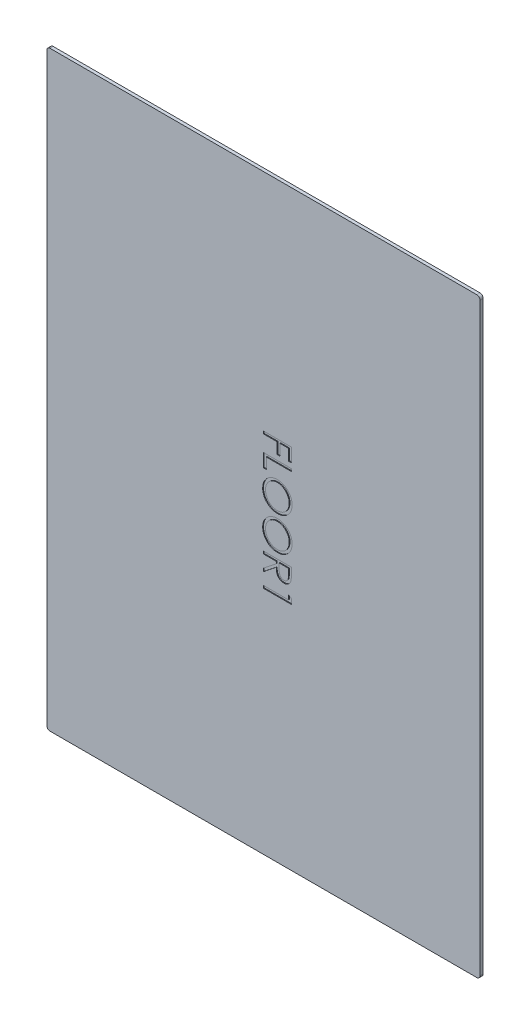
from build123d import *

# Parameters (mm, degrees)
ESQUISSE1_W             = 542
ESQUISSE1_H             = 740
BOSS_EXTRU_1_DEPTH      = 4
CONG_1_R                = 4
ENL_V_MAT_EXTRU_1_DEPTH = 1


with BuildPart() as part:
    # Esquisse1 → Boss.-Extru.1 (new body)
    with BuildSketch(Plane.XY):
        with Locations((-271, -370)):
            Rectangle(ESQUISSE1_W, ESQUISSE1_H)
    extrude(amount=BOSS_EXTRU_1_DEPTH)

    # Cong_1
    cong_1_edges = [part.edges().sort_by_distance(p)[0] for p in [
        (0, -740, 2),
        (-542, -740, 2),
        (-542, 0, 2),
        (0, 0, 2),
    ]]
    fillet(cong_1_edges, radius=CONG_1_R)

    # Esquisse2 → Enl_v. mat.-Extru.1 (cut)
    # profile 1 of 6: a face of its own
    with BuildSketch(Plane.XY.offset(4)):
        Polygon((-236, -281.153846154), (-236, -298.205128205), (-239.58974359, -298.205128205), (-239.58974359, -284.294871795), (-250.358974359, -284.294871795), (-250.358974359, -298.205128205), (-253.948717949, -298.205128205), (-253.948717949, -284.294871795), (-271, -284.294871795), (-271, -281.153846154), align=None)
    # profile 2 of 6: a face of its own
    with BuildSketch(Plane.XY.offset(4)):
        Polygon((-236, -304.487179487), (-236, -307.628205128), (-267.41025641, -307.628205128), (-267.41025641, -321.08974359), (-271, -321.08974359), (-271, -304.487179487), align=None)
    # profile 3 of 6: a face of its own
    with BuildSketch(Plane.XY.offset(4)):
        with BuildLine():
            add(Edge.make_bspline(
                [(-235.102564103, -343.301282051), (-235.118979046, -343.94936298), (-235.151219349, -345.222247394), (-235.398008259, -347.092998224), (-235.824969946, -348.878942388), (-236.393571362, -350.594668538), (-237.152220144, -352.219506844), (-238.068678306, -353.766238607), (-239.155980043, -355.230490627), (-240.395880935, -356.598841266), (-241.749861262, -357.846415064), (-243.198967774, -358.936411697), (-244.723357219, -359.857995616), (-246.328334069, -360.613353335), (-248.006834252, -361.20647446), (-249.76840141, -361.615628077), (-251.601460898, -361.877019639), (-252.851730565, -361.907576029), (-253.485977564, -361.923076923)],
                knots=[0, 0, 0, 0, 1.06508495, 2.091914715, 3.094501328, 4.079693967, 5.057647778, 6.035986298, 7.030177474, 8.050107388, 9.066943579, 10.051896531, 11.025616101, 11.9896488, 12.96281505, 13.945825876, 14.957941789, 16, 16, 16, 16], degree=3))
            add(Edge.make_bspline(
                [(-253.485977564, -361.923076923), (-254.115552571, -361.907578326), (-255.356517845, -361.877028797), (-257.177944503, -361.615330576), (-258.928880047, -361.204958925), (-260.606231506, -360.61885528), (-262.212399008, -359.867126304), (-263.739590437, -358.939313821), (-265.198730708, -357.85653367), (-266.559283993, -356.613272), (-267.809308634, -355.259614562), (-268.900999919, -353.806421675), (-269.833930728, -352.283532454), (-270.584107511, -350.679525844), (-271.181426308, -349.012283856), (-271.589061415, -347.266526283), (-271.8519022, -345.450042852), (-271.882091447, -344.211335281), (-271.897435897, -343.581730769)],
                knots=[0, 0, 0, 0, 1.04355943, 2.056976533, 3.044937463, 4.02179873, 4.997890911, 5.980248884, 6.980147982, 8.006253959, 9.032111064, 10.031228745, 11.015595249, 11.988180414, 12.962670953, 13.946861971, 14.95644057, 16, 16, 16, 16], degree=3))
            add(Edge.make_bspline(
                [(-271.897435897, -343.581730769), (-271.881944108, -342.947486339), (-271.851405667, -341.697221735), (-271.589561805, -339.861869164), (-271.1802581, -338.099026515), (-270.594763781, -336.414121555), (-269.840929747, -334.806601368), (-268.914579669, -333.276621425), (-267.823003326, -331.822343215), (-266.581396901, -330.458565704), (-265.227088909, -329.212257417), (-263.783447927, -328.116057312), (-262.264203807, -327.195047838), (-260.675619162, -326.440895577), (-259.021800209, -325.844389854), (-257.292343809, -325.437303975), (-255.496941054, -325.17395468), (-254.274513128, -325.143604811), (-253.654246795, -325.128205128)],
                knots=[0, 0, 0, 0, 1.053167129, 2.076072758, 3.073341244, 4.055601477, 5.033424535, 6.017524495, 7.021518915, 8.049444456, 9.077120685, 10.074910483, 11.055688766, 12.022980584, 12.991883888, 13.970269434, 14.970104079, 16, 16, 16, 16], degree=3))
            add(Edge.make_bspline(
                [(-253.654246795, -325.128205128), (-253.237918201, -325.133546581), (-252.410513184, -325.144162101), (-251.181875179, -325.272151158), (-249.972863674, -325.457497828), (-248.78754278, -325.72451813), (-247.625718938, -326.068951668), (-246.489768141, -326.493407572), (-245.370333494, -326.979834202), (-244.288719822, -327.558992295), (-243.243229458, -328.190871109), (-242.246935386, -328.879871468), (-241.317634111, -329.630797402), (-240.440393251, -330.432922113), (-239.630185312, -331.297348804), (-238.869345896, -332.21106788), (-238.165750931, -333.178860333), (-237.534177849, -334.202256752), (-236.9540703, -335.255165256), (-236.469728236, -336.345224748), (-236.041634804, -337.449436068), (-235.701427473, -338.577525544), (-235.430688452, -339.726883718), (-235.246728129, -340.898947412), (-235.118454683, -342.092509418), (-235.107883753, -342.896624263), (-235.102564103, -343.301282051)],
                knots=[0, 0, 0, 0, 1.037115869, 2.061148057, 3.07517727, 4.084041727, 5.086514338, 6.092668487, 7.104487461, 8.125783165, 9.147610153, 10.147694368, 11.141876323, 12.122903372, 13.107606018, 14.091946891, 15.084523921, 16.086505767, 17.087268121, 18.077809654, 19.05670789, 20.036870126, 21.011670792, 21.99694167, 22.991993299, 24, 24, 24, 24], degree=3))
        make_face()
        with BuildLine():
            add(Edge.make_bspline(
                [(-238.692307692, -343.455528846), (-238.696354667, -343.123381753), (-238.704409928, -342.462262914), (-238.810595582, -341.479428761), (-238.961787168, -340.509467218), (-239.178002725, -339.552431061), (-239.469885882, -338.613470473), (-239.81380792, -337.683208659), (-240.218380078, -336.766112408), (-240.690121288, -335.872434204), (-241.205447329, -335.00366783), (-241.771035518, -334.178267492), (-242.384143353, -333.404467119), (-243.036672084, -332.679787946), (-243.735260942, -332.006341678), (-244.468760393, -331.370477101), (-245.258286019, -330.797786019), (-246.082388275, -330.272928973), (-246.940004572, -329.803250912), (-247.822103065, -329.385597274), (-248.735879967, -329.04395721), (-249.671421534, -328.765333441), (-250.627246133, -328.534335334), (-251.61060462, -328.387996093), (-252.616555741, -328.280672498), (-253.296374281, -328.273074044), (-253.640224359, -328.269230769)],
                knots=[0, 0, 0, 0, 1.008585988, 2.007529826, 2.999688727, 3.990042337, 4.984966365, 5.984641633, 7.001812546, 8.027570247, 9.052811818, 10.068991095, 11.064725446, 12.050001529, 13.029093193, 14.010961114, 14.996492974, 15.989185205, 16.977398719, 17.96520407, 18.951579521, 19.937648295, 20.929603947, 21.935788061, 22.955928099, 24, 24, 24, 24], degree=3))
            add(Edge.make_bspline(
                [(-253.640224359, -328.269230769), (-254.145846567, -328.281979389), (-255.14056187, -328.307059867), (-256.598243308, -328.526635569), (-257.999126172, -328.864855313), (-259.335545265, -329.363428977), (-260.618988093, -329.986935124), (-261.83806914, -330.757204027), (-262.993117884, -331.669794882), (-264.076070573, -332.706430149), (-265.064528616, -333.839657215), (-265.932162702, -335.042984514), (-266.6662652, -336.303520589), (-267.264315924, -337.624552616), (-267.738213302, -338.999028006), (-268.062999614, -340.435803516), (-268.276754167, -341.925308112), (-268.297281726, -342.940614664), (-268.307692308, -343.455528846)],
                knots=[0, 0, 0, 0, 1.032063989, 2.030389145, 3.003944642, 3.970395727, 4.937377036, 5.913328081, 6.909231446, 7.93887556, 8.970685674, 9.976071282, 10.964166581, 11.944589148, 12.933237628, 13.927779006, 14.949070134, 16, 16, 16, 16], degree=3))
            add(Edge.make_bspline(
                [(-268.307692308, -343.455528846), (-268.302937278, -343.801623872), (-268.293506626, -344.488034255), (-268.198519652, -345.508989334), (-268.04620173, -346.511551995), (-267.826892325, -347.494312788), (-267.552430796, -348.45616832), (-267.226314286, -349.401088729), (-266.819649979, -350.319175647), (-266.369613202, -351.221381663), (-265.860258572, -352.085129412), (-265.302576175, -352.904616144), (-264.700433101, -353.67509096), (-264.053570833, -354.39822266), (-263.3675655, -355.076335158), (-262.624778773, -355.691014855), (-261.846903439, -356.270566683), (-261.020878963, -356.793322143), (-260.161455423, -357.262066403), (-259.276015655, -357.669668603), (-258.367602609, -358.015679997), (-257.434676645, -358.294951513), (-256.479070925, -358.513809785), (-255.499489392, -358.664607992), (-254.49789617, -358.770092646), (-253.820457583, -358.778043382), (-253.478966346, -358.782051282)],
                knots=[0, 0, 0, 0, 1.047226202, 2.076964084, 3.100341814, 4.114585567, 5.122123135, 6.126552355, 7.137064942, 8.158803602, 9.176592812, 10.169297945, 11.156925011, 12.133779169, 13.104132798, 14.073170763, 15.049307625, 16.038276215, 17.028988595, 18.010110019, 18.986169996, 19.968539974, 20.955178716, 21.950601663, 22.966915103, 24, 24, 24, 24], degree=3))
            add(Edge.make_bspline(
                [(-253.478966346, -358.782051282), (-253.139811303, -358.778040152), (-252.467034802, -358.770083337), (-251.472426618, -358.664658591), (-250.499894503, -358.513649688), (-249.553256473, -358.296022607), (-248.632271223, -358.01552107), (-247.737803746, -357.669647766), (-246.866521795, -357.261794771), (-246.020578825, -356.793712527), (-245.208831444, -356.267554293), (-244.432807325, -355.692611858), (-243.707079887, -355.058958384), (-243.013733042, -354.384698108), (-242.367553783, -353.652989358), (-241.76832996, -352.867146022), (-241.201591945, -352.036710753), (-240.690356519, -351.157432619), (-240.218138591, -350.250014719), (-239.813906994, -349.318795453), (-239.468398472, -348.372692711), (-239.179197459, -347.416550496), (-238.961575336, -346.443633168), (-238.810649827, -345.45960644), (-238.704398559, -344.462788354), (-238.696350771, -343.792347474), (-238.692307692, -343.455528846)],
                knots=[0, 0, 0, 0, 1.029967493, 2.04313025, 3.035375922, 4.01889446, 4.991458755, 5.958017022, 6.930036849, 7.912118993, 8.892942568, 9.867138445, 10.843712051, 11.817804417, 12.803729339, 13.806387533, 14.818654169, 15.856205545, 16.894655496, 17.924916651, 18.938004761, 19.953404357, 20.957695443, 21.963967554, 22.97713031, 24, 24, 24, 24], degree=3))
        make_face(mode=Mode.SUBTRACT)
    # profile 4 of 6: a face of its own
    with BuildSketch(Plane.XY.offset(4)):
        with BuildLine():
            add(Edge.make_bspline(
                [(-235.102564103, -385.480769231), (-235.118979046, -386.128850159), (-235.151219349, -387.401734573), (-235.398008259, -389.272485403), (-235.824969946, -391.058429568), (-236.393571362, -392.774155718), (-237.152220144, -394.398994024), (-238.068678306, -395.945725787), (-239.155980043, -397.409977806), (-240.395880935, -398.778328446), (-241.749861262, -400.025902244), (-243.198967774, -401.115898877), (-244.723357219, -402.037482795), (-246.328334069, -402.792840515), (-248.006834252, -403.38596164), (-249.76840141, -403.795115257), (-251.601460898, -404.056506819), (-252.851730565, -404.087063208), (-253.485977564, -404.102564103)],
                knots=[0, 0, 0, 0, 1.06508495, 2.091914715, 3.094501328, 4.079693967, 5.057647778, 6.035986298, 7.030177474, 8.050107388, 9.066943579, 10.051896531, 11.025616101, 11.9896488, 12.96281505, 13.945825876, 14.957941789, 16, 16, 16, 16], degree=3))
            add(Edge.make_bspline(
                [(-253.485977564, -404.102564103), (-254.115552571, -404.087065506), (-255.356517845, -404.056515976), (-257.177944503, -403.794817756), (-258.928880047, -403.384446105), (-260.606231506, -402.79834246), (-262.212399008, -402.046613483), (-263.739590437, -401.118801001), (-265.198730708, -400.03602085), (-266.559283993, -398.79275918), (-267.809308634, -397.439101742), (-268.900999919, -395.985908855), (-269.833930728, -394.463019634), (-270.584107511, -392.859013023), (-271.181426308, -391.191771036), (-271.589061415, -389.446013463), (-271.8519022, -387.629530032), (-271.882091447, -386.390822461), (-271.897435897, -385.761217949)],
                knots=[0, 0, 0, 0, 1.04355943, 2.056976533, 3.044937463, 4.02179873, 4.997890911, 5.980248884, 6.980147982, 8.006253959, 9.032111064, 10.031228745, 11.015595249, 11.988180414, 12.962670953, 13.946861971, 14.95644057, 16, 16, 16, 16], degree=3))
            add(Edge.make_bspline(
                [(-271.897435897, -385.761217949), (-271.881944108, -385.126973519), (-271.851405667, -383.876708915), (-271.589561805, -382.041356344), (-271.1802581, -380.278513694), (-270.594763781, -378.593608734), (-269.840929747, -376.986088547), (-268.914579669, -375.456108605), (-267.823003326, -374.001830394), (-266.581396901, -372.638052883), (-265.227088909, -371.391744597), (-263.783447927, -370.295544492), (-262.264203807, -369.374535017), (-260.675619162, -368.620382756), (-259.021800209, -368.023877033), (-257.292343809, -367.616791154), (-255.496941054, -367.35344186), (-254.274513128, -367.32309199), (-253.654246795, -367.307692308)],
                knots=[0, 0, 0, 0, 1.053167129, 2.076072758, 3.073341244, 4.055601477, 5.033424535, 6.017524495, 7.021518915, 8.049444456, 9.077120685, 10.074910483, 11.055688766, 12.022980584, 12.991883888, 13.970269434, 14.970104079, 16, 16, 16, 16], degree=3))
            add(Edge.make_bspline(
                [(-253.654246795, -367.307692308), (-253.237918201, -367.31303376), (-252.410513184, -367.323649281), (-251.181875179, -367.451638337), (-249.972863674, -367.636985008), (-248.78754278, -367.904005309), (-247.625718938, -368.248438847), (-246.489768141, -368.672894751), (-245.370333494, -369.159321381), (-244.288719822, -369.738479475), (-243.243229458, -370.370358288), (-242.246935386, -371.059358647), (-241.317634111, -371.810284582), (-240.440393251, -372.612409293), (-239.630185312, -373.476835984), (-238.869345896, -374.39055506), (-238.165750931, -375.358347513), (-237.534177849, -376.381743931), (-236.9540703, -377.434652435), (-236.469728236, -378.524711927), (-236.041634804, -379.628923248), (-235.701427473, -380.757012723), (-235.430688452, -381.906370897), (-235.246728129, -383.078434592), (-235.118454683, -384.271996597), (-235.107883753, -385.076111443), (-235.102564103, -385.480769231)],
                knots=[0, 0, 0, 0, 1.037115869, 2.061148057, 3.07517727, 4.084041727, 5.086514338, 6.092668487, 7.104487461, 8.125783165, 9.147610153, 10.147694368, 11.141876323, 12.122903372, 13.107606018, 14.091946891, 15.084523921, 16.086505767, 17.087268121, 18.077809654, 19.05670789, 20.036870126, 21.011670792, 21.99694167, 22.991993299, 24, 24, 24, 24], degree=3))
        make_face()
        with BuildLine():
            add(Edge.make_bspline(
                [(-238.692307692, -385.635016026), (-238.696354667, -385.302868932), (-238.704409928, -384.641750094), (-238.810595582, -383.65891594), (-238.961787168, -382.688954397), (-239.178002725, -381.731918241), (-239.469885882, -380.792957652), (-239.81380792, -379.862695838), (-240.218380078, -378.945599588), (-240.690121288, -378.051921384), (-241.205447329, -377.18315501), (-241.771035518, -376.357754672), (-242.384143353, -375.583954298), (-243.036672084, -374.859275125), (-243.735260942, -374.185828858), (-244.468760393, -373.549964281), (-245.258286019, -372.977273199), (-246.082388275, -372.452416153), (-246.940004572, -371.982738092), (-247.822103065, -371.565084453), (-248.735879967, -371.22344439), (-249.671421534, -370.94482062), (-250.627246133, -370.713822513), (-251.61060462, -370.567483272), (-252.616555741, -370.460159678), (-253.296374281, -370.452561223), (-253.640224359, -370.448717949)],
                knots=[0, 0, 0, 0, 1.008585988, 2.007529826, 2.999688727, 3.990042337, 4.984966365, 5.984641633, 7.001812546, 8.027570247, 9.052811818, 10.068991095, 11.064725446, 12.050001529, 13.029093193, 14.010961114, 14.996492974, 15.989185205, 16.977398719, 17.96520407, 18.951579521, 19.937648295, 20.929603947, 21.935788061, 22.955928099, 24, 24, 24, 24], degree=3))
            add(Edge.make_bspline(
                [(-253.640224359, -370.448717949), (-254.145846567, -370.461466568), (-255.14056187, -370.486547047), (-256.598243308, -370.706122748), (-257.999126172, -371.044342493), (-259.335545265, -371.542916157), (-260.618988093, -372.166422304), (-261.83806914, -372.936691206), (-262.993117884, -373.849282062), (-264.076070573, -374.885917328), (-265.064528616, -376.019144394), (-265.932162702, -377.222471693), (-266.6662652, -378.483007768), (-267.264315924, -379.804039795), (-267.738213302, -381.178515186), (-268.062999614, -382.615290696), (-268.276754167, -384.104795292), (-268.297281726, -385.120101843), (-268.307692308, -385.635016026)],
                knots=[0, 0, 0, 0, 1.032063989, 2.030389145, 3.003944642, 3.970395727, 4.937377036, 5.913328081, 6.909231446, 7.93887556, 8.970685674, 9.976071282, 10.964166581, 11.944589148, 12.933237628, 13.927779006, 14.949070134, 16, 16, 16, 16], degree=3))
            add(Edge.make_bspline(
                [(-268.307692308, -385.635016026), (-268.302937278, -385.981111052), (-268.293506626, -386.667521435), (-268.198519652, -387.688476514), (-268.04620173, -388.691039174), (-267.826892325, -389.673799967), (-267.552430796, -390.635655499), (-267.226314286, -391.580575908), (-266.819649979, -392.498662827), (-266.369613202, -393.400868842), (-265.860258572, -394.264616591), (-265.302576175, -395.084103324), (-264.700433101, -395.854578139), (-264.053570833, -396.57770984), (-263.3675655, -397.255822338), (-262.624778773, -397.870502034), (-261.846903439, -398.450053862), (-261.020878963, -398.972809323), (-260.161455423, -399.441553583), (-259.276015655, -399.849155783), (-258.367602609, -400.195167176), (-257.434676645, -400.474438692), (-256.479070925, -400.693296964), (-255.499489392, -400.844095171), (-254.49789617, -400.949579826), (-253.820457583, -400.957530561), (-253.478966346, -400.961538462)],
                knots=[0, 0, 0, 0, 1.047226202, 2.076964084, 3.100341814, 4.114585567, 5.122123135, 6.126552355, 7.137064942, 8.158803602, 9.176592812, 10.169297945, 11.156925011, 12.133779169, 13.104132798, 14.073170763, 15.049307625, 16.038276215, 17.028988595, 18.010110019, 18.986169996, 19.968539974, 20.955178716, 21.950601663, 22.966915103, 24, 24, 24, 24], degree=3))
            add(Edge.make_bspline(
                [(-253.478966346, -400.961538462), (-253.139811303, -400.957527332), (-252.467034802, -400.949570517), (-251.472426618, -400.844145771), (-250.499894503, -400.693136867), (-249.553256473, -400.475509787), (-248.632271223, -400.195008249), (-247.737803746, -399.849134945), (-246.866521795, -399.441281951), (-246.020578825, -398.973199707), (-245.208831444, -398.447041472), (-244.432807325, -397.872099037), (-243.707079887, -397.238445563), (-243.013733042, -396.564185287), (-242.367553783, -395.832476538), (-241.76832996, -395.046633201), (-241.201591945, -394.216197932), (-240.690356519, -393.336919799), (-240.218138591, -392.429501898), (-239.813906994, -391.498282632), (-239.468398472, -390.55217989), (-239.179197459, -389.596037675), (-238.961575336, -388.623120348), (-238.810649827, -387.63909362), (-238.704398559, -386.642275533), (-238.696350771, -385.971834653), (-238.692307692, -385.635016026)],
                knots=[0, 0, 0, 0, 1.029967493, 2.04313025, 3.035375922, 4.01889446, 4.991458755, 5.958017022, 6.930036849, 7.912118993, 8.892942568, 9.867138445, 10.843712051, 11.817804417, 12.803729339, 13.806387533, 14.818654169, 15.856205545, 16.894655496, 17.924916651, 18.938004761, 19.953404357, 20.957695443, 21.963967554, 22.97713031, 24, 24, 24, 24], degree=3))
        make_face(mode=Mode.SUBTRACT)
    # profile 5 of 6: a face of its own
    with BuildSketch(Plane.XY.offset(4)):
        with BuildLine():
            Line((-236, -411.282051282), (-236, -418.286258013))
            add(Edge.make_bspline(
                [(-236, -418.286258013), (-236.00155586, -418.753669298), (-236.004543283, -419.651150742), (-236.021200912, -420.936883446), (-236.068944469, -422.105154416), (-236.110030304, -423.155352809), (-236.184949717, -424.087459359), (-236.256556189, -424.904332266), (-236.350292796, -425.602209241), (-236.437347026, -426.024667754), (-236.476762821, -426.215945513)],
                knots=[0, 0, 0, 0, 1.410062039, 2.707475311, 3.878576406, 4.937260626, 5.877586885, 6.699081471, 7.410979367, 8, 8, 8, 8], degree=3))
            add(Edge.make_bspline(
                [(-236.476762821, -426.215945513), (-236.540023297, -426.472016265), (-236.665194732, -426.978695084), (-236.929894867, -427.708130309), (-237.235706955, -428.403514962), (-237.597682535, -429.06223947), (-238.009507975, -429.684364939), (-238.473589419, -430.268959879), (-238.992290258, -430.812681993), (-239.552365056, -431.319714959), (-240.158700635, -431.779324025), (-240.802464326, -432.177055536), (-241.479629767, -432.517631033), (-242.192555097, -432.789522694), (-242.935213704, -433.008251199), (-243.714090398, -433.162527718), (-244.525703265, -433.255035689), (-245.079281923, -433.264454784), (-245.359975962, -433.269230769)],
                knots=[0, 0, 0, 0, 1.02737288, 2.032829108, 3.019628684, 3.985738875, 4.958353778, 5.924249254, 6.890702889, 7.883913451, 8.865824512, 9.85161466, 10.829249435, 11.81541824, 12.821369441, 13.843154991, 14.906364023, 16, 16, 16, 16], degree=3))
            add(Edge.make_bspline(
                [(-245.359975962, -433.269230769), (-245.826327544, -433.254541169), (-246.73630027, -433.225877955), (-248.056901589, -432.958621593), (-249.288822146, -432.52087587), (-250.430347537, -431.917571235), (-251.459827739, -431.149641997), (-252.360995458, -430.226765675), (-253.122072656, -429.153655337), (-253.644238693, -428.149969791), (-253.980222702, -427.262945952), (-254.217809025, -426.530549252), (-254.398278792, -425.731021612), (-254.562300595, -424.875833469), (-254.687462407, -423.958379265), (-254.776351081, -422.980506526), (-254.833507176, -421.939769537), (-254.841857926, -421.226371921), (-254.846153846, -420.859375)],
                knots=[0, 0, 0, 0, 1.260402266, 2.459371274, 3.627181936, 4.786749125, 5.93865593, 7.087644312, 8.261344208, 9.485713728, 10.136162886, 10.825977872, 11.566646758, 12.35154167, 13.181268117, 14.0701832, 15.007234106, 16, 16, 16, 16], degree=3))
            Line((-254.846153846, -420.859375), (-271, -433.717948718))
            Line((-271, -433.717948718), (-271, -429.833733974))
            Line((-271, -429.833733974), (-254.846153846, -416.975160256))
            Line((-254.846153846, -416.975160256), (-254.846153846, -414.423076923))
            Line((-254.846153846, -414.423076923), (-271, -414.423076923))
            Line((-271, -414.423076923), (-271, -411.282051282))
            Line((-271, -411.282051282), (-236, -411.282051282))
        make_face()
        with BuildLine():
            Line((-239.58974359, -414.423076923), (-251.256410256, -414.423076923))
            Line((-251.256410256, -414.423076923), (-251.305488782, -420.831330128))
            add(Edge.make_bspline(
                [(-251.305488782, -420.831330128), (-251.305621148, -421.130530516), (-251.30587771, -421.710466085), (-251.26593996, -422.54947275), (-251.220506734, -423.33067381), (-251.151013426, -424.051081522), (-251.061452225, -424.711016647), (-250.949423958, -425.310152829), (-250.818898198, -425.84945667), (-250.616903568, -426.478470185), (-250.296697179, -427.180645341), (-249.831615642, -427.944705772), (-249.24285939, -428.593157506), (-248.580325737, -429.152248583), (-247.836901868, -429.582891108), (-247.04558557, -429.896323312), (-246.213208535, -430.093019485), (-245.641490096, -430.116403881), (-245.352964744, -430.128205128)],
                knots=[0, 0, 0, 0, 1.14660753, 2.222451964, 3.218720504, 4.145691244, 4.995719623, 5.770487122, 6.480909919, 7.121111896, 8.299844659, 9.430703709, 10.534634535, 11.641396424, 12.741395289, 13.810956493, 14.895269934, 16, 16, 16, 16], degree=3))
            add(Edge.make_bspline(
                [(-245.352964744, -430.128205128), (-245.071420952, -430.116367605), (-244.51350389, -430.092909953), (-243.698969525, -429.895942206), (-242.92470091, -429.577868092), (-242.205456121, -429.131854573), (-241.547136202, -428.592915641), (-240.991647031, -427.952845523), (-240.526457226, -427.243878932), (-240.231355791, -426.58077671), (-240.050070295, -425.988495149), (-239.922658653, -425.474174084), (-239.819430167, -424.890826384), (-239.73917197, -424.239850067), (-239.666948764, -423.522422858), (-239.62012115, -422.736580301), (-239.591818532, -421.883229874), (-239.590451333, -421.291758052), (-239.58974359, -420.985576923)],
                knots=[0, 0, 0, 0, 1.100801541, 2.181386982, 3.260112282, 4.364594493, 5.481957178, 6.577424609, 7.668452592, 8.790448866, 9.403819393, 10.091598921, 10.863153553, 11.720938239, 12.658472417, 13.685008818, 14.801622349, 16, 16, 16, 16], degree=3))
            Line((-239.58974359, -420.985576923), (-239.58974359, -414.423076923))
        make_face(mode=Mode.SUBTRACT)
    # profile 6 of 6: a face of its own
    with BuildSketch(Plane.XY.offset(4)):
        Polygon((-236, -445.1953125), (-236, -451.666666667), (-271, -451.666666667), (-271, -448.525641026), (-239.58974359, -448.525641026), (-239.58974359, -443.141025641), align=None)
    extrude(amount=-ENL_V_MAT_EXTRU_1_DEPTH, mode=Mode.SUBTRACT)


solid = part.part
